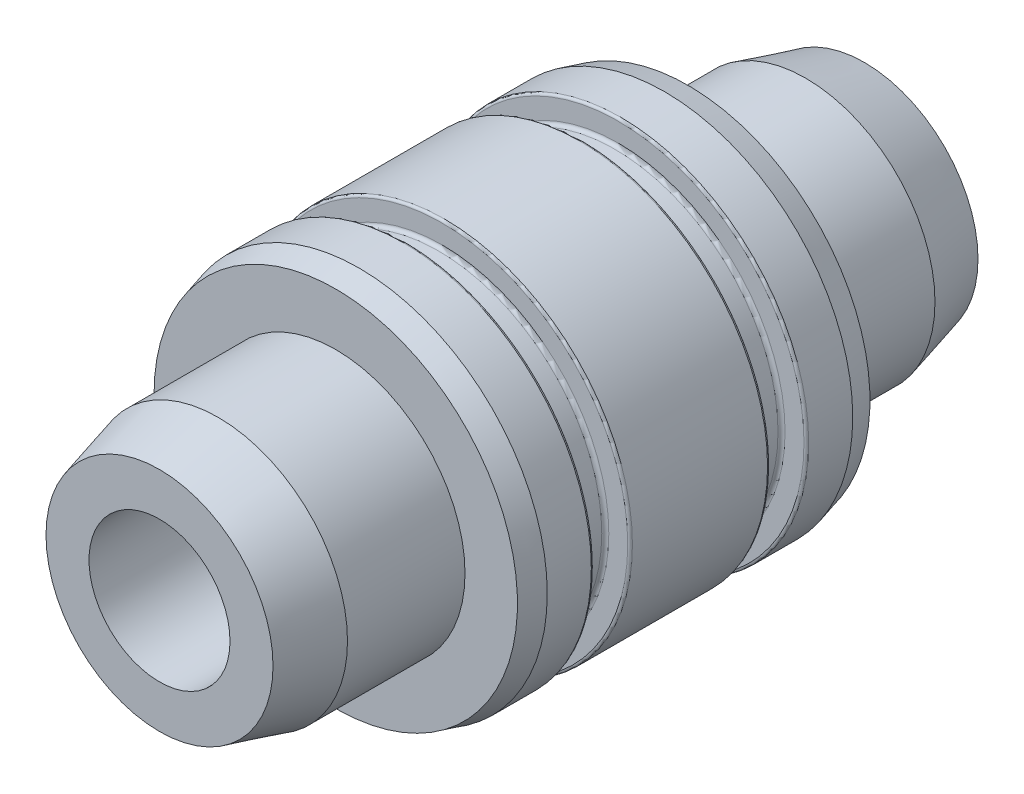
from build123d import *

# Parameters (mm, degrees)
ESQUISSE1_R                           = 16
EXTRUSION1_DEPTH                      = 15
ESQUISSE3_R                           = 11
EXTRUSION2_DEPTH                      = 15
ESQUISSE4_R                           = 6
ENL_V_MAT_EXTRU_1_DEPTH               = 15
CHANFREIN1_SIZE                       = 5
CHANFREIN1_SIZE2                      = 1.339745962
CHANFREIN2_SIZE                       = 2
CHANFREIN2_SIZE2                      = 0.535898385
DIAM_TRE_DU_PER_AGE_M8_0_8_000000_1_D = 8
CONG_1_R                              = 0.2
R_P_TITION_LIN_AIRE1_COUNT            = 2
R_P_TITION_LIN_AIRE1_PITCH            = 15
CONG_1_OF_R_P_TITION_LIN_AIRE1_R      = 0.2


with BuildPart() as part:
    # Esquisse1 → Extrusion1 (new body)
    with BuildSketch(Plane.XY):
        Circle(ESQUISSE1_R)
    extrude(amount=EXTRUSION1_DEPTH)

    # Esquisse3 → Extrusion2 (add)
    with BuildSketch(Plane.XY.offset(15)):
        Circle(ESQUISSE3_R)
    extrude(amount=EXTRUSION2_DEPTH)

    # Esquisse4 → Enl_v. mat.-Extru.1 (cut)
    with BuildSketch(Plane.XY.offset(30)):
        Circle(ESQUISSE4_R)
    extrude(amount=-ENL_V_MAT_EXTRU_1_DEPTH, mode=Mode.SUBTRACT)

    # Chanfrein1
    chanfrein1_edges = [part.edges().sort_by_distance(p)[0] for p in [
        (-11, 0, 30),
    ]]
    chanfrein1_side = [part.faces().sort_by_distance(p)[0] for p in [
        (-11, 0, 22.5),
    ]]
    chamfer(chanfrein1_edges, length=CHANFREIN1_SIZE, length2=CHANFREIN1_SIZE2, reference=chanfrein1_side[0])

    # Chanfrein2
    chanfrein2_edges = [part.edges().sort_by_distance(p)[0] for p in [
        (-16, 0, 15),
    ]]
    chanfrein2_side = [part.faces().sort_by_distance(p)[0] for p in [
        (-16, 0, 7.5),
    ]]
    chamfer(chanfrein2_edges, length=CHANFREIN2_SIZE, length2=CHANFREIN2_SIZE2, reference=chanfrein2_side[0])

    # Sym_trie5: part across plane


with BuildPart() as part_1:
    add(part.part)
    add(part.part.mirror(Plane.XY))

    # Diam_tre du per_age M8.0 _8.000000_1 (through all)
    with Locations(Plane.XY.offset(15)):
        with Locations((0, 0)):
            Hole(DIAM_TRE_DU_PER_AGE_M8_0_8_000000_1_D / 2)

    # Esquisse7 → Enl_vement de mati_re-R_volution1 (revolve, cut)
    with BuildSketch(Plane(origin=(0, 0, 0), x_dir=(0, 0, -1), z_dir=(1, 0, 0)), mode=Mode.PRIVATE) as enl_vement_de_mati_re_r_volution1_sk:
        with BuildLine():
            Line((-9.05, 16), (-5.95, 16))
            Line((-5.95, 16), (-5.95, 14.19))
            ThreePointArc((-5.95, 14.19), (-6.037867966, 13.977867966), (-6.25, 13.89))
            Line((-6.25, 13.89), (-8.75, 13.89))
            ThreePointArc((-8.75, 13.89), (-8.962132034, 13.977867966), (-9.05, 14.19))
            Line((-9.05, 14.19), (-9.05, 16))
        make_face()
    enl_vement_de_mati_re_r_volution1 = revolve(enl_vement_de_mati_re_r_volution1_sk.sketch.rotate(Axis((0, 0, 16.143741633), (0, 0, -1)), 270), axis=Axis((0, 0, 16.143741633), (0, 0, -1)), mode=Mode.SUBTRACT)

    # Cong_1
    cong_1_edges = [part_1.edges().sort_by_distance(p)[0] for p in [
        (-16, 0, 9.05),
        (-16, 0, 5.95),
    ]]
    fillet(cong_1_edges, radius=CONG_1_R)

    # R_p_tition lin_aire1: Enl_vement de mati_re-R_volution1 ×2
    with Locations(*[(0, 0, -i * R_P_TITION_LIN_AIRE1_PITCH) for i in range(1, R_P_TITION_LIN_AIRE1_COUNT)]):
        add(enl_vement_de_mati_re_r_volution1, mode=Mode.SUBTRACT)

    # Cong_1 of R_p_tition lin_aire1
    cong_1_of_r_p_tition_lin_aire1_edges = [part_1.edges().sort_by_distance(p)[0] for p in [
        (-16, 0, -5.95),
        (-16, 0, -9.05),
    ]]
    fillet(cong_1_of_r_p_tition_lin_aire1_edges, radius=CONG_1_OF_R_P_TITION_LIN_AIRE1_R)


solid = part_1.part
